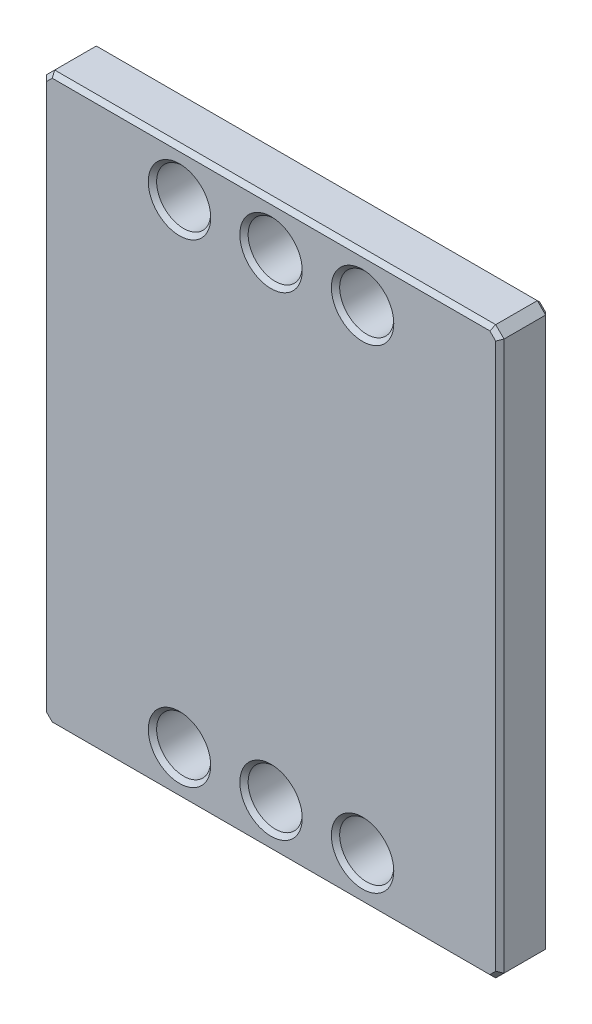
ISO-10303-21;
HEADER;
FILE_DESCRIPTION(('STEP AP214'),'2;1');
FILE_NAME('part.step','',(''),(''),'','','');
FILE_SCHEMA(('AUTOMOTIVE_DESIGN { 1 0 10303 214 1 1 1 1 }'));
ENDSEC;
DATA;
#1=APPLICATION_CONTEXT('core data for automotive mechanical design processes');
#2=APPLICATION_PROTOCOL_DEFINITION('international standard','automotive_design',2000,#1);
#3=PRODUCT_CONTEXT('',#1,'mechanical');
#4=PRODUCT('Part','Part','',(#3));
#5=PRODUCT_RELATED_PRODUCT_CATEGORY('part','',(#4));
#6=PRODUCT_DEFINITION_FORMATION('','',#4);
#7=PRODUCT_DEFINITION_CONTEXT('part definition',#1,'design');
#8=PRODUCT_DEFINITION('design','',#6,#7);
#9=PRODUCT_DEFINITION_SHAPE('','',#8);
#10=(LENGTH_UNIT() NAMED_UNIT(*) SI_UNIT(.MILLI.,.METRE.));
#11=(NAMED_UNIT(*) PLANE_ANGLE_UNIT() SI_UNIT($,.RADIAN.));
#12=(NAMED_UNIT(*) SI_UNIT($,.STERADIAN.) SOLID_ANGLE_UNIT());
#13=UNCERTAINTY_MEASURE_WITH_UNIT(LENGTH_MEASURE(1.E-05),#10,'distance_accuracy_value','');
#14=(GEOMETRIC_REPRESENTATION_CONTEXT(3) GLOBAL_UNCERTAINTY_ASSIGNED_CONTEXT((#13)) GLOBAL_UNIT_ASSIGNED_CONTEXT((#10,
#11,#12)) REPRESENTATION_CONTEXT('',''));
#15=CARTESIAN_POINT('',(0.,0.,0.));
#16=DIRECTION('',(0.,0.,1.));
#17=DIRECTION('',(1.,0.,0.));
#18=AXIS2_PLACEMENT_3D('',#15,#16,#17);
#19=CARTESIAN_POINT('',(0.,0.,6.));
#20=DIRECTION('',(0.,0.,1.));
#21=DIRECTION('',(1.,0.,0.));
#22=AXIS2_PLACEMENT_3D('',#19,#20,#21);
#23=PLANE('',#22);
#24=CARTESIAN_POINT('',(-10.9999999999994,5.5,6.));
#25=DIRECTION('',(0.,0.,1.));
#26=DIRECTION('',(1.,0.,0.));
#27=AXIS2_PLACEMENT_3D('',#24,#25,#26);
#28=CIRCLE('',#27,3.75000000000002);
#29=CARTESIAN_POINT('',(-7.24999999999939,5.5,6.));
#30=VERTEX_POINT('',#29);
#31=EDGE_CURVE('E11',#30,#30,#28,.F.);
#32=ORIENTED_EDGE('',*,*,#31,.T.);
#33=EDGE_LOOP('',(#32));
#34=FACE_BOUND('',#33,.T.);
#35=CARTESIAN_POINT('',(5.96744875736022E-13,5.5,6.));
#36=DIRECTION('',(0.,0.,1.));
#37=DIRECTION('',(1.,0.,0.));
#38=AXIS2_PLACEMENT_3D('',#35,#36,#37);
#39=CIRCLE('',#38,3.75000000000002);
#40=CARTESIAN_POINT('',(3.75000000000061,5.5,6.));
#41=VERTEX_POINT('',#40);
#42=EDGE_CURVE('E42',#41,#41,#39,.F.);
#43=ORIENTED_EDGE('',*,*,#42,.T.);
#44=EDGE_LOOP('',(#43));
#45=FACE_BOUND('',#44,.T.);
#46=CARTESIAN_POINT('',(0.,62.5,6.));
#47=DIRECTION('',(0.,0.,1.));
#48=DIRECTION('',(1.,0.,0.));
#49=AXIS2_PLACEMENT_3D('',#46,#47,#48);
#50=CIRCLE('',#49,3.75000000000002);
#51=CARTESIAN_POINT('',(3.75000000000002,62.5,6.));
#52=VERTEX_POINT('',#51);
#53=EDGE_CURVE('E280',#52,#52,#50,.F.);
#54=ORIENTED_EDGE('',*,*,#53,.T.);
#55=EDGE_LOOP('',(#54));
#56=FACE_BOUND('',#55,.T.);
#57=DIRECTION('',(0.,-1.,0.));
#58=VECTOR('',#57,1.);
#59=CARTESIAN_POINT('',(-27.,1.00000000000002,6.));
#60=LINE('',#59,#58);
#61=CARTESIAN_POINT('',(-27.,66.7928932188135,6.));
#62=VERTEX_POINT('',#61);
#63=CARTESIAN_POINT('',(-27.,1.20710678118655,6.));
#64=VERTEX_POINT('',#63);
#65=EDGE_CURVE('E50',#62,#64,#60,.T.);
#66=ORIENTED_EDGE('',*,*,#65,.T.);
#67=DIRECTION('',(0.70710678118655,-0.707106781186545,0.));
#68=VECTOR('',#67,1.);
#69=CARTESIAN_POINT('',(-12.8964466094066,-12.8964466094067,6.));
#70=LINE('',#69,#68);
#71=CARTESIAN_POINT('',(-26.2928932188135,0.5,6.));
#72=VERTEX_POINT('',#71);
#73=EDGE_CURVE('E278',#64,#72,#70,.T.);
#74=ORIENTED_EDGE('',*,*,#73,.T.);
#75=DIRECTION('',(1.,0.,0.));
#76=VECTOR('',#75,1.);
#77=CARTESIAN_POINT('',(26.5,0.5,6.));
#78=LINE('',#77,#76);
#79=CARTESIAN_POINT('',(26.2928932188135,0.5,6.));
#80=VERTEX_POINT('',#79);
#81=EDGE_CURVE('E266',#72,#80,#78,.T.);
#82=ORIENTED_EDGE('',*,*,#81,.T.);
#83=DIRECTION('',(0.707106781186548,0.707106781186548,0.));
#84=VECTOR('',#83,1.);
#85=CARTESIAN_POINT('',(12.8964466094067,-12.8964466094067,6.));
#86=LINE('',#85,#84);
#87=CARTESIAN_POINT('',(27.,1.20710678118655,6.));
#88=VERTEX_POINT('',#87);
#89=EDGE_CURVE('E268',#80,#88,#86,.T.);
#90=ORIENTED_EDGE('',*,*,#89,.T.);
#91=DIRECTION('',(0.,1.,0.));
#92=VECTOR('',#91,1.);
#93=CARTESIAN_POINT('',(27.,67.,6.));
#94=LINE('',#93,#92);
#95=CARTESIAN_POINT('',(27.,66.7928932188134,6.));
#96=VERTEX_POINT('',#95);
#97=EDGE_CURVE('E270',#88,#96,#94,.T.);
#98=ORIENTED_EDGE('',*,*,#97,.T.);
#99=DIRECTION('',(-0.70710678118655,0.707106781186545,0.));
#100=VECTOR('',#99,1.);
#101=CARTESIAN_POINT('',(46.8964466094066,46.896446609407,6.));
#102=LINE('',#101,#100);
#103=CARTESIAN_POINT('',(26.2928932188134,67.5,6.));
#104=VERTEX_POINT('',#103);
#105=EDGE_CURVE('E272',#96,#104,#102,.T.);
#106=ORIENTED_EDGE('',*,*,#105,.T.);
#107=DIRECTION('',(-1.,0.,0.));
#108=VECTOR('',#107,1.);
#109=CARTESIAN_POINT('',(-26.5,67.5,6.));
#110=LINE('',#109,#108);
#111=CARTESIAN_POINT('',(-26.2928932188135,67.5,6.));
#112=VERTEX_POINT('',#111);
#113=EDGE_CURVE('E274',#104,#112,#110,.T.);
#114=ORIENTED_EDGE('',*,*,#113,.T.);
#115=DIRECTION('',(-0.707106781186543,-0.707106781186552,0.));
#116=VECTOR('',#115,1.);
#117=CARTESIAN_POINT('',(-46.8964466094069,46.8964466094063,6.));
#118=LINE('',#117,#116);
#119=EDGE_CURVE('E55',#112,#62,#118,.T.);
#120=ORIENTED_EDGE('',*,*,#119,.T.);
#121=EDGE_LOOP('',(#66,#74,#82,#90,#98,#106,#114,#120));
#122=FACE_BOUND('',#121,.T.);
#123=CARTESIAN_POINT('',(-11.,62.5,6.));
#124=DIRECTION('',(0.,0.,1.));
#125=DIRECTION('',(1.,0.,0.));
#126=AXIS2_PLACEMENT_3D('',#123,#124,#125);
#127=CIRCLE('',#126,3.75000000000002);
#128=CARTESIAN_POINT('',(-7.24999999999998,62.5,6.));
#129=VERTEX_POINT('',#128);
#130=EDGE_CURVE('E263',#129,#129,#127,.F.);
#131=ORIENTED_EDGE('',*,*,#130,.T.);
#132=EDGE_LOOP('',(#131));
#133=FACE_BOUND('',#132,.T.);
#134=CARTESIAN_POINT('',(11.,62.5,6.));
#135=DIRECTION('',(0.,0.,1.));
#136=DIRECTION('',(1.,0.,0.));
#137=AXIS2_PLACEMENT_3D('',#134,#135,#136);
#138=CIRCLE('',#137,3.75000000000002);
#139=CARTESIAN_POINT('',(14.75,62.5,6.));
#140=VERTEX_POINT('',#139);
#141=EDGE_CURVE('E260',#140,#140,#138,.F.);
#142=ORIENTED_EDGE('',*,*,#141,.T.);
#143=EDGE_LOOP('',(#142));
#144=FACE_BOUND('',#143,.T.);
#145=CARTESIAN_POINT('',(11.0000000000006,5.5,6.));
#146=DIRECTION('',(0.,0.,1.));
#147=DIRECTION('',(1.,0.,0.));
#148=AXIS2_PLACEMENT_3D('',#145,#146,#147);
#149=CIRCLE('',#148,3.75000000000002);
#150=CARTESIAN_POINT('',(14.7500000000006,5.5,6.));
#151=VERTEX_POINT('',#150);
#152=EDGE_CURVE('E257',#151,#151,#149,.F.);
#153=ORIENTED_EDGE('',*,*,#152,.T.);
#154=EDGE_LOOP('',(#153));
#155=FACE_BOUND('',#154,.T.);
#156=ADVANCED_FACE('F33',(#34,#45,#56,#122,#133,#144,#155),#23,.T.);
#157=CARTESIAN_POINT('',(0.,0.,0.));
#158=DIRECTION('',(0.,0.,1.));
#159=DIRECTION('',(1.,0.,0.));
#160=AXIS2_PLACEMENT_3D('',#157,#158,#159);
#161=PLANE('',#160);
#162=CARTESIAN_POINT('',(-10.9999999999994,5.5,0.));
#163=DIRECTION('',(0.,0.,1.));
#164=DIRECTION('',(1.,0.,0.));
#165=AXIS2_PLACEMENT_3D('',#162,#163,#164);
#166=CIRCLE('',#165,3.74999999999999);
#167=CARTESIAN_POINT('',(-7.24999999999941,5.5,0.));
#168=VERTEX_POINT('',#167);
#169=EDGE_CURVE('E186',#168,#168,#166,.T.);
#170=ORIENTED_EDGE('',*,*,#169,.T.);
#171=EDGE_LOOP('',(#170));
#172=FACE_BOUND('',#171,.T.);
#173=CARTESIAN_POINT('',(5.96744875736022E-13,5.5,0.));
#174=DIRECTION('',(0.,0.,1.));
#175=DIRECTION('',(1.,0.,0.));
#176=AXIS2_PLACEMENT_3D('',#173,#174,#175);
#177=CIRCLE('',#176,3.74999999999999);
#178=CARTESIAN_POINT('',(3.75000000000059,5.5,0.));
#179=VERTEX_POINT('',#178);
#180=EDGE_CURVE('E178',#179,#179,#177,.T.);
#181=ORIENTED_EDGE('',*,*,#180,.T.);
#182=EDGE_LOOP('',(#181));
#183=FACE_BOUND('',#182,.T.);
#184=CARTESIAN_POINT('',(0.,62.5,0.));
#185=DIRECTION('',(0.,0.,1.));
#186=DIRECTION('',(1.,0.,0.));
#187=AXIS2_PLACEMENT_3D('',#184,#185,#186);
#188=CIRCLE('',#187,3.74999999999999);
#189=CARTESIAN_POINT('',(3.74999999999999,62.5,0.));
#190=VERTEX_POINT('',#189);
#191=EDGE_CURVE('E175',#190,#190,#188,.T.);
#192=ORIENTED_EDGE('',*,*,#191,.T.);
#193=EDGE_LOOP('',(#192));
#194=FACE_BOUND('',#193,.T.);
#195=DIRECTION('',(1.,0.,0.));
#196=VECTOR('',#195,1.);
#197=CARTESIAN_POINT('',(0.,67.5,0.));
#198=LINE('',#197,#196);
#199=CARTESIAN_POINT('',(-26.2928932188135,67.5,0.));
#200=VERTEX_POINT('',#199);
#201=CARTESIAN_POINT('',(26.2928932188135,67.5,0.));
#202=VERTEX_POINT('',#201);
#203=EDGE_CURVE('E173',#200,#202,#198,.T.);
#204=ORIENTED_EDGE('',*,*,#203,.T.);
#205=DIRECTION('',(0.70710678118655,-0.707106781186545,0.));
#206=VECTOR('',#205,1.);
#207=CARTESIAN_POINT('',(27.1464466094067,66.6464466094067,0.));
#208=LINE('',#207,#206);
#209=CARTESIAN_POINT('',(27.,66.7928932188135,0.));
#210=VERTEX_POINT('',#209);
#211=EDGE_CURVE('E153',#202,#210,#208,.T.);
#212=ORIENTED_EDGE('',*,*,#211,.T.);
#213=DIRECTION('',(0.,-1.,0.));
#214=VECTOR('',#213,1.);
#215=CARTESIAN_POINT('',(27.,0.,0.));
#216=LINE('',#215,#214);
#217=CARTESIAN_POINT('',(27.,1.20710678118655,0.));
#218=VERTEX_POINT('',#217);
#219=EDGE_CURVE('E161',#210,#218,#216,.T.);
#220=ORIENTED_EDGE('',*,*,#219,.T.);
#221=DIRECTION('',(-0.707106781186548,-0.707106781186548,0.));
#222=VECTOR('',#221,1.);
#223=CARTESIAN_POINT('',(26.1464466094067,0.353553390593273,0.));
#224=LINE('',#223,#222);
#225=CARTESIAN_POINT('',(26.2928932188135,0.500000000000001,0.));
#226=VERTEX_POINT('',#225);
#227=EDGE_CURVE('E167',#218,#226,#224,.T.);
#228=ORIENTED_EDGE('',*,*,#227,.T.);
#229=DIRECTION('',(-1.,0.,0.));
#230=VECTOR('',#229,1.);
#231=CARTESIAN_POINT('',(0.,0.5,0.));
#232=LINE('',#231,#230);
#233=CARTESIAN_POINT('',(-26.2928932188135,0.5,0.));
#234=VERTEX_POINT('',#233);
#235=EDGE_CURVE('E375',#226,#234,#232,.T.);
#236=ORIENTED_EDGE('',*,*,#235,.T.);
#237=DIRECTION('',(-0.70710678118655,0.707106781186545,0.));
#238=VECTOR('',#237,1.);
#239=CARTESIAN_POINT('',(-27.1464466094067,1.35355339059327,0.));
#240=LINE('',#239,#238);
#241=CARTESIAN_POINT('',(-27.,1.20710678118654,0.));
#242=VERTEX_POINT('',#241);
#243=EDGE_CURVE('E377',#234,#242,#240,.T.);
#244=ORIENTED_EDGE('',*,*,#243,.T.);
#245=DIRECTION('',(0.,1.,0.));
#246=VECTOR('',#245,1.);
#247=CARTESIAN_POINT('',(-27.,0.,0.));
#248=LINE('',#247,#246);
#249=CARTESIAN_POINT('',(-27.,66.7928932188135,0.));
#250=VERTEX_POINT('',#249);
#251=EDGE_CURVE('E379',#242,#250,#248,.T.);
#252=ORIENTED_EDGE('',*,*,#251,.T.);
#253=DIRECTION('',(0.707106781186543,0.707106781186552,0.));
#254=VECTOR('',#253,1.);
#255=CARTESIAN_POINT('',(-26.1464466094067,67.6464466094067,0.));
#256=LINE('',#255,#254);
#257=EDGE_CURVE('E180',#250,#200,#256,.T.);
#258=ORIENTED_EDGE('',*,*,#257,.T.);
#259=EDGE_LOOP('',(#204,#212,#220,#228,#236,#244,#252,#258));
#260=FACE_BOUND('',#259,.T.);
#261=CARTESIAN_POINT('',(-11.,62.5,0.));
#262=DIRECTION('',(0.,0.,1.));
#263=DIRECTION('',(1.,0.,0.));
#264=AXIS2_PLACEMENT_3D('',#261,#262,#263);
#265=CIRCLE('',#264,3.74999999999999);
#266=CARTESIAN_POINT('',(-7.25000000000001,62.5,0.));
#267=VERTEX_POINT('',#266);
#268=EDGE_CURVE('E168',#267,#267,#265,.T.);
#269=ORIENTED_EDGE('',*,*,#268,.T.);
#270=EDGE_LOOP('',(#269));
#271=FACE_BOUND('',#270,.T.);
#272=CARTESIAN_POINT('',(11.,62.5,0.));
#273=DIRECTION('',(0.,0.,1.));
#274=DIRECTION('',(1.,0.,0.));
#275=AXIS2_PLACEMENT_3D('',#272,#273,#274);
#276=CIRCLE('',#275,3.74999999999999);
#277=CARTESIAN_POINT('',(14.75,62.5,0.));
#278=VERTEX_POINT('',#277);
#279=EDGE_CURVE('E369',#278,#278,#276,.T.);
#280=ORIENTED_EDGE('',*,*,#279,.T.);
#281=EDGE_LOOP('',(#280));
#282=FACE_BOUND('',#281,.T.);
#283=CARTESIAN_POINT('',(11.0000000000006,5.5,0.));
#284=DIRECTION('',(0.,0.,1.));
#285=DIRECTION('',(1.,0.,0.));
#286=AXIS2_PLACEMENT_3D('',#283,#284,#285);
#287=CIRCLE('',#286,3.74999999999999);
#288=CARTESIAN_POINT('',(14.7500000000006,5.5,0.));
#289=VERTEX_POINT('',#288);
#290=EDGE_CURVE('E366',#289,#289,#287,.T.);
#291=ORIENTED_EDGE('',*,*,#290,.T.);
#292=EDGE_LOOP('',(#291));
#293=FACE_BOUND('',#292,.T.);
#294=ADVANCED_FACE('F170',(#172,#183,#194,#260,#271,#282,#293),#161,.F.);
#295=CARTESIAN_POINT('',(-27.5,68.,6.));
#296=DIRECTION('',(1.,0.,0.));
#297=DIRECTION('',(0.,1.,0.));
#298=AXIS2_PLACEMENT_3D('',#295,#296,#297);
#299=PLANE('',#298);
#300=DIRECTION('',(0.,0.,-1.));
#301=VECTOR('',#300,1.);
#302=CARTESIAN_POINT('',(-27.5,67.,6.));
#303=LINE('',#302,#301);
#304=CARTESIAN_POINT('',(-27.5,67.,5.5));
#305=VERTEX_POINT('',#304);
#306=CARTESIAN_POINT('',(-27.5,67.,0.5));
#307=VERTEX_POINT('',#306);
#308=EDGE_CURVE('E356',#305,#307,#303,.T.);
#309=ORIENTED_EDGE('',*,*,#308,.T.);
#310=DIRECTION('',(0.,-1.,0.));
#311=VECTOR('',#310,1.);
#312=CARTESIAN_POINT('',(-27.5,68.,0.5));
#313=LINE('',#312,#311);
#314=CARTESIAN_POINT('',(-27.5,1.,0.5));
#315=VERTEX_POINT('',#314);
#316=EDGE_CURVE('E220',#307,#315,#313,.T.);
#317=ORIENTED_EDGE('',*,*,#316,.T.);
#318=DIRECTION('',(0.,0.,1.));
#319=VECTOR('',#318,1.);
#320=CARTESIAN_POINT('',(-27.5,1.,6.));
#321=LINE('',#320,#319);
#322=CARTESIAN_POINT('',(-27.5,1.,5.5));
#323=VERTEX_POINT('',#322);
#324=EDGE_CURVE('E359',#315,#323,#321,.T.);
#325=ORIENTED_EDGE('',*,*,#324,.T.);
#326=DIRECTION('',(0.,1.,0.));
#327=VECTOR('',#326,1.);
#328=CARTESIAN_POINT('',(-27.5,67.,5.5));
#329=LINE('',#328,#327);
#330=EDGE_CURVE('E218',#323,#305,#329,.T.);
#331=ORIENTED_EDGE('',*,*,#330,.T.);
#332=EDGE_LOOP('',(#309,#317,#325,#331));
#333=FACE_BOUND('',#332,.T.);
#334=ADVANCED_FACE('F436',(#333),#299,.F.);
#335=CARTESIAN_POINT('',(-27.5,0.,6.));
#336=DIRECTION('',(0.,1.,0.));
#337=DIRECTION('',(0.,0.,1.));
#338=AXIS2_PLACEMENT_3D('',#335,#336,#337);
#339=PLANE('',#338);
#340=DIRECTION('',(0.,0.,-1.));
#341=VECTOR('',#340,1.);
#342=CARTESIAN_POINT('',(-26.5,0.,6.));
#343=LINE('',#342,#341);
#344=CARTESIAN_POINT('',(-26.5,0.,5.5));
#345=VERTEX_POINT('',#344);
#346=CARTESIAN_POINT('',(-26.5,0.,0.5));
#347=VERTEX_POINT('',#346);
#348=EDGE_CURVE('E348',#345,#347,#343,.T.);
#349=ORIENTED_EDGE('',*,*,#348,.T.);
#350=DIRECTION('',(1.,0.,0.));
#351=VECTOR('',#350,1.);
#352=CARTESIAN_POINT('',(-27.5,0.,0.5));
#353=LINE('',#352,#351);
#354=CARTESIAN_POINT('',(26.5,0.,0.5));
#355=VERTEX_POINT('',#354);
#356=EDGE_CURVE('E229',#347,#355,#353,.T.);
#357=ORIENTED_EDGE('',*,*,#356,.T.);
#358=DIRECTION('',(0.,0.,1.));
#359=VECTOR('',#358,1.);
#360=CARTESIAN_POINT('',(26.5,0.,6.));
#361=LINE('',#360,#359);
#362=CARTESIAN_POINT('',(26.5,0.,5.5));
#363=VERTEX_POINT('',#362);
#364=EDGE_CURVE('E353',#355,#363,#361,.T.);
#365=ORIENTED_EDGE('',*,*,#364,.T.);
#366=DIRECTION('',(-1.,0.,0.));
#367=VECTOR('',#366,1.);
#368=CARTESIAN_POINT('',(-26.5,0.,5.5));
#369=LINE('',#368,#367);
#370=EDGE_CURVE('E227',#363,#345,#369,.T.);
#371=ORIENTED_EDGE('',*,*,#370,.T.);
#372=EDGE_LOOP('',(#349,#357,#365,#371));
#373=FACE_BOUND('',#372,.T.);
#374=ADVANCED_FACE('F420',(#373),#339,.F.);
#375=CARTESIAN_POINT('',(27.5,68.,6.));
#376=DIRECTION('',(-1.,0.,0.));
#377=DIRECTION('',(0.,-1.,0.));
#378=AXIS2_PLACEMENT_3D('',#375,#376,#377);
#379=PLANE('',#378);
#380=DIRECTION('',(0.,0.,-1.));
#381=VECTOR('',#380,1.);
#382=CARTESIAN_POINT('',(27.5,1.,6.));
#383=LINE('',#382,#381);
#384=CARTESIAN_POINT('',(27.5,1.,5.5));
#385=VERTEX_POINT('',#384);
#386=CARTESIAN_POINT('',(27.5,1.,0.5));
#387=VERTEX_POINT('',#386);
#388=EDGE_CURVE('E346',#385,#387,#383,.T.);
#389=ORIENTED_EDGE('',*,*,#388,.T.);
#390=DIRECTION('',(0.,1.,0.));
#391=VECTOR('',#390,1.);
#392=CARTESIAN_POINT('',(27.5,68.,0.5));
#393=LINE('',#392,#391);
#394=CARTESIAN_POINT('',(27.5,67.,0.5));
#395=VERTEX_POINT('',#394);
#396=EDGE_CURVE('E237',#387,#395,#393,.T.);
#397=ORIENTED_EDGE('',*,*,#396,.T.);
#398=DIRECTION('',(0.,0.,1.));
#399=VECTOR('',#398,1.);
#400=CARTESIAN_POINT('',(27.5,67.,6.));
#401=LINE('',#400,#399);
#402=CARTESIAN_POINT('',(27.5,67.,5.5));
#403=VERTEX_POINT('',#402);
#404=EDGE_CURVE('E302',#395,#403,#401,.T.);
#405=ORIENTED_EDGE('',*,*,#404,.T.);
#406=DIRECTION('',(0.,-1.,0.));
#407=VECTOR('',#406,1.);
#408=CARTESIAN_POINT('',(27.5,1.00000000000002,5.5));
#409=LINE('',#408,#407);
#410=EDGE_CURVE('E235',#403,#385,#409,.T.);
#411=ORIENTED_EDGE('',*,*,#410,.T.);
#412=EDGE_LOOP('',(#389,#397,#405,#411));
#413=FACE_BOUND('',#412,.T.);
#414=ADVANCED_FACE('F344',(#413),#379,.F.);
#415=CARTESIAN_POINT('',(-27.5,68.,6.));
#416=DIRECTION('',(0.,-1.,0.));
#417=DIRECTION('',(0.,0.,-1.));
#418=AXIS2_PLACEMENT_3D('',#415,#416,#417);
#419=PLANE('',#418);
#420=DIRECTION('',(0.,0.,-1.));
#421=VECTOR('',#420,1.);
#422=CARTESIAN_POINT('',(26.5,68.,6.));
#423=LINE('',#422,#421);
#424=CARTESIAN_POINT('',(26.5,68.,5.5));
#425=VERTEX_POINT('',#424);
#426=CARTESIAN_POINT('',(26.5,68.,0.5));
#427=VERTEX_POINT('',#426);
#428=EDGE_CURVE('E341',#425,#427,#423,.T.);
#429=ORIENTED_EDGE('',*,*,#428,.T.);
#430=DIRECTION('',(-1.,0.,0.));
#431=VECTOR('',#430,1.);
#432=CARTESIAN_POINT('',(-27.5,68.,0.5));
#433=LINE('',#432,#431);
#434=CARTESIAN_POINT('',(-26.5,68.,0.5));
#435=VERTEX_POINT('',#434);
#436=EDGE_CURVE('E212',#427,#435,#433,.T.);
#437=ORIENTED_EDGE('',*,*,#436,.T.);
#438=DIRECTION('',(0.,0.,1.));
#439=VECTOR('',#438,1.);
#440=CARTESIAN_POINT('',(-26.5,68.,6.));
#441=LINE('',#440,#439);
#442=CARTESIAN_POINT('',(-26.5,68.,5.5));
#443=VERTEX_POINT('',#442);
#444=EDGE_CURVE('E362',#435,#443,#441,.T.);
#445=ORIENTED_EDGE('',*,*,#444,.T.);
#446=DIRECTION('',(1.,0.,0.));
#447=VECTOR('',#446,1.);
#448=CARTESIAN_POINT('',(26.5,68.,5.5));
#449=LINE('',#448,#447);
#450=EDGE_CURVE('E210',#443,#425,#449,.T.);
#451=ORIENTED_EDGE('',*,*,#450,.T.);
#452=EDGE_LOOP('',(#429,#437,#445,#451));
#453=FACE_BOUND('',#452,.T.);
#454=ADVANCED_FACE('F392',(#453),#419,.F.);
#455=CARTESIAN_POINT('',(-11.,62.5,6.));
#456=DIRECTION('',(0.,0.,-1.));
#457=DIRECTION('',(-1.,0.,0.));
#458=AXIS2_PLACEMENT_3D('',#455,#456,#457);
#459=CYLINDRICAL_SURFACE('',#458,3.25);
#460=CARTESIAN_POINT('',(-11.,62.5,0.499999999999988));
#461=DIRECTION('',(0.,0.,1.));
#462=DIRECTION('',(1.,0.,0.));
#463=AXIS2_PLACEMENT_3D('',#460,#461,#462);
#464=CIRCLE('',#463,3.25);
#465=CARTESIAN_POINT('',(-7.75,62.5,0.499999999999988));
#466=VERTEX_POINT('',#465);
#467=EDGE_CURVE('E242',#466,#466,#464,.F.);
#468=ORIENTED_EDGE('',*,*,#467,.T.);
#469=EDGE_LOOP('',(#468));
#470=FACE_BOUND('',#469,.T.);
#471=CARTESIAN_POINT('',(-11.,62.5,5.49999999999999));
#472=DIRECTION('',(0.,0.,1.));
#473=DIRECTION('',(1.,0.,0.));
#474=AXIS2_PLACEMENT_3D('',#471,#472,#473);
#475=CIRCLE('',#474,3.25);
#476=CARTESIAN_POINT('',(-7.75,62.5,5.49999999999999));
#477=VERTEX_POINT('',#476);
#478=EDGE_CURVE('E239',#477,#477,#475,.T.);
#479=ORIENTED_EDGE('',*,*,#478,.T.);
#480=EDGE_LOOP('',(#479));
#481=FACE_BOUND('',#480,.T.);
#482=ADVANCED_FACE('F454',(#470,#481),#459,.F.);
#483=CARTESIAN_POINT('',(0.,62.5,6.));
#484=DIRECTION('',(0.,0.,-1.));
#485=DIRECTION('',(-1.,0.,0.));
#486=AXIS2_PLACEMENT_3D('',#483,#484,#485);
#487=CYLINDRICAL_SURFACE('',#486,3.25);
#488=CARTESIAN_POINT('',(0.,62.5,0.499999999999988));
#489=DIRECTION('',(0.,0.,1.));
#490=DIRECTION('',(1.,0.,0.));
#491=AXIS2_PLACEMENT_3D('',#488,#489,#490);
#492=CIRCLE('',#491,3.25);
#493=CARTESIAN_POINT('',(3.25,62.5,0.499999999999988));
#494=VERTEX_POINT('',#493);
#495=EDGE_CURVE('E204',#494,#494,#492,.F.);
#496=ORIENTED_EDGE('',*,*,#495,.T.);
#497=EDGE_LOOP('',(#496));
#498=FACE_BOUND('',#497,.T.);
#499=CARTESIAN_POINT('',(0.,62.5,5.49999999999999));
#500=DIRECTION('',(0.,0.,1.));
#501=DIRECTION('',(1.,0.,0.));
#502=AXIS2_PLACEMENT_3D('',#499,#500,#501);
#503=CIRCLE('',#502,3.25);
#504=CARTESIAN_POINT('',(3.25,62.5,5.49999999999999));
#505=VERTEX_POINT('',#504);
#506=EDGE_CURVE('E201',#505,#505,#503,.T.);
#507=ORIENTED_EDGE('',*,*,#506,.T.);
#508=EDGE_LOOP('',(#507));
#509=FACE_BOUND('',#508,.T.);
#510=ADVANCED_FACE('F474',(#498,#509),#487,.F.);
#511=CARTESIAN_POINT('',(11.,62.5,6.));
#512=DIRECTION('',(0.,0.,-1.));
#513=DIRECTION('',(-1.,0.,0.));
#514=AXIS2_PLACEMENT_3D('',#511,#512,#513);
#515=CYLINDRICAL_SURFACE('',#514,3.25);
#516=CARTESIAN_POINT('',(11.,62.5,0.499999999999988));
#517=DIRECTION('',(0.,0.,1.));
#518=DIRECTION('',(1.,0.,0.));
#519=AXIS2_PLACEMENT_3D('',#516,#517,#518);
#520=CIRCLE('',#519,3.25);
#521=CARTESIAN_POINT('',(14.25,62.5,0.499999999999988));
#522=VERTEX_POINT('',#521);
#523=EDGE_CURVE('E248',#522,#522,#520,.F.);
#524=ORIENTED_EDGE('',*,*,#523,.T.);
#525=EDGE_LOOP('',(#524));
#526=FACE_BOUND('',#525,.T.);
#527=CARTESIAN_POINT('',(11.,62.5,5.49999999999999));
#528=DIRECTION('',(0.,0.,1.));
#529=DIRECTION('',(1.,0.,0.));
#530=AXIS2_PLACEMENT_3D('',#527,#528,#529);
#531=CIRCLE('',#530,3.25);
#532=CARTESIAN_POINT('',(14.25,62.5,5.49999999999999));
#533=VERTEX_POINT('',#532);
#534=EDGE_CURVE('E245',#533,#533,#531,.T.);
#535=ORIENTED_EDGE('',*,*,#534,.T.);
#536=EDGE_LOOP('',(#535));
#537=FACE_BOUND('',#536,.T.);
#538=ADVANCED_FACE('F481',(#526,#537),#515,.F.);
#539=CARTESIAN_POINT('',(5.96744875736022E-13,5.5,6.));
#540=DIRECTION('',(0.,0.,-1.));
#541=DIRECTION('',(-1.,0.,0.));
#542=AXIS2_PLACEMENT_3D('',#539,#540,#541);
#543=CYLINDRICAL_SURFACE('',#542,3.25);
#544=CARTESIAN_POINT('',(5.96744875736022E-13,5.5,0.499999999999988));
#545=DIRECTION('',(0.,0.,1.));
#546=DIRECTION('',(1.,0.,0.));
#547=AXIS2_PLACEMENT_3D('',#544,#545,#546);
#548=CIRCLE('',#547,3.25);
#549=CARTESIAN_POINT('',(3.2500000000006,5.5,0.499999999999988));
#550=VERTEX_POINT('',#549);
#551=EDGE_CURVE('E198',#550,#550,#548,.F.);
#552=ORIENTED_EDGE('',*,*,#551,.T.);
#553=EDGE_LOOP('',(#552));
#554=FACE_BOUND('',#553,.T.);
#555=CARTESIAN_POINT('',(5.96744875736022E-13,5.5,5.49999999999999));
#556=DIRECTION('',(0.,0.,1.));
#557=DIRECTION('',(1.,0.,0.));
#558=AXIS2_PLACEMENT_3D('',#555,#556,#557);
#559=CIRCLE('',#558,3.25);
#560=CARTESIAN_POINT('',(3.2500000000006,5.5,5.49999999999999));
#561=VERTEX_POINT('',#560);
#562=EDGE_CURVE('E195',#561,#561,#559,.T.);
#563=ORIENTED_EDGE('',*,*,#562,.T.);
#564=EDGE_LOOP('',(#563));
#565=FACE_BOUND('',#564,.T.);
#566=ADVANCED_FACE('F488',(#554,#565),#543,.F.);
#567=CARTESIAN_POINT('',(11.0000000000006,5.5,6.));
#568=DIRECTION('',(0.,0.,-1.));
#569=DIRECTION('',(-1.,0.,0.));
#570=AXIS2_PLACEMENT_3D('',#567,#568,#569);
#571=CYLINDRICAL_SURFACE('',#570,3.25);
#572=CARTESIAN_POINT('',(11.0000000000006,5.5,0.499999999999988));
#573=DIRECTION('',(0.,0.,1.));
#574=DIRECTION('',(1.,0.,0.));
#575=AXIS2_PLACEMENT_3D('',#572,#573,#574);
#576=CIRCLE('',#575,3.25);
#577=CARTESIAN_POINT('',(14.2500000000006,5.5,0.499999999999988));
#578=VERTEX_POINT('',#577);
#579=EDGE_CURVE('E254',#578,#578,#576,.F.);
#580=ORIENTED_EDGE('',*,*,#579,.T.);
#581=EDGE_LOOP('',(#580));
#582=FACE_BOUND('',#581,.T.);
#583=CARTESIAN_POINT('',(11.0000000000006,5.5,5.49999999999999));
#584=DIRECTION('',(0.,0.,1.));
#585=DIRECTION('',(1.,0.,0.));
#586=AXIS2_PLACEMENT_3D('',#583,#584,#585);
#587=CIRCLE('',#586,3.25);
#588=CARTESIAN_POINT('',(14.2500000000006,5.5,5.49999999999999));
#589=VERTEX_POINT('',#588);
#590=EDGE_CURVE('E251',#589,#589,#587,.T.);
#591=ORIENTED_EDGE('',*,*,#590,.T.);
#592=EDGE_LOOP('',(#591));
#593=FACE_BOUND('',#592,.T.);
#594=ADVANCED_FACE('F496',(#582,#593),#571,.F.);
#595=CARTESIAN_POINT('',(-10.9999999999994,5.5,6.));
#596=DIRECTION('',(0.,0.,-1.));
#597=DIRECTION('',(-1.,0.,0.));
#598=AXIS2_PLACEMENT_3D('',#595,#596,#597);
#599=CYLINDRICAL_SURFACE('',#598,3.25);
#600=CARTESIAN_POINT('',(-10.9999999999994,5.5,0.499999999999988));
#601=DIRECTION('',(0.,0.,1.));
#602=DIRECTION('',(1.,0.,0.));
#603=AXIS2_PLACEMENT_3D('',#600,#601,#602);
#604=CIRCLE('',#603,3.25);
#605=CARTESIAN_POINT('',(-7.7499999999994,5.5,0.499999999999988));
#606=VERTEX_POINT('',#605);
#607=EDGE_CURVE('E192',#606,#606,#604,.F.);
#608=ORIENTED_EDGE('',*,*,#607,.T.);
#609=EDGE_LOOP('',(#608));
#610=FACE_BOUND('',#609,.T.);
#611=CARTESIAN_POINT('',(-10.9999999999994,5.5,5.49999999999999));
#612=DIRECTION('',(0.,0.,1.));
#613=DIRECTION('',(1.,0.,0.));
#614=AXIS2_PLACEMENT_3D('',#611,#612,#613);
#615=CIRCLE('',#614,3.25);
#616=CARTESIAN_POINT('',(-7.7499999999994,5.5,5.49999999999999));
#617=VERTEX_POINT('',#616);
#618=EDGE_CURVE('E189',#617,#617,#615,.T.);
#619=ORIENTED_EDGE('',*,*,#618,.T.);
#620=EDGE_LOOP('',(#619));
#621=FACE_BOUND('',#620,.T.);
#622=ADVANCED_FACE('F504',(#610,#621),#599,.F.);
#623=CARTESIAN_POINT('',(27.5,1.,6.));
#624=DIRECTION('',(-0.707106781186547,0.707106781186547,0.));
#625=DIRECTION('',(0.,0.,-1.));
#626=AXIS2_PLACEMENT_3D('',#623,#624,#625);
#627=PLANE('',#626);
#628=ORIENTED_EDGE('',*,*,#364,.F.);
#629=DIRECTION('',(-0.707106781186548,-0.707106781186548,0.));
#630=VECTOR('',#629,1.);
#631=CARTESIAN_POINT('',(27.5,1.00000000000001,0.500000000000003));
#632=LINE('',#631,#630);
#633=EDGE_CURVE('E233',#355,#387,#632,.F.);
#634=ORIENTED_EDGE('',*,*,#633,.T.);
#635=ORIENTED_EDGE('',*,*,#388,.F.);
#636=DIRECTION('',(0.707106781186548,0.707106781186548,0.));
#637=VECTOR('',#636,1.);
#638=CARTESIAN_POINT('',(27.5,1.,5.5));
#639=LINE('',#638,#637);
#640=EDGE_CURVE('E231',#385,#363,#639,.F.);
#641=ORIENTED_EDGE('',*,*,#640,.T.);
#642=EDGE_LOOP('',(#628,#634,#635,#641));
#643=FACE_BOUND('',#642,.T.);
#644=ADVANCED_FACE('F512',(#643),#627,.F.);
#645=CARTESIAN_POINT('',(-26.5,0.,6.));
#646=DIRECTION('',(0.707106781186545,0.70710678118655,0.));
#647=DIRECTION('',(0.,0.,-1.));
#648=AXIS2_PLACEMENT_3D('',#645,#646,#647);
#649=PLANE('',#648);
#650=ORIENTED_EDGE('',*,*,#324,.F.);
#651=DIRECTION('',(-0.70710678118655,0.707106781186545,0.));
#652=VECTOR('',#651,1.);
#653=CARTESIAN_POINT('',(-26.5,0.,0.499999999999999));
#654=LINE('',#653,#652);
#655=EDGE_CURVE('E225',#315,#347,#654,.F.);
#656=ORIENTED_EDGE('',*,*,#655,.T.);
#657=ORIENTED_EDGE('',*,*,#348,.F.);
#658=DIRECTION('',(0.70710678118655,-0.707106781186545,0.));
#659=VECTOR('',#658,1.);
#660=CARTESIAN_POINT('',(-26.5,0.,5.5));
#661=LINE('',#660,#659);
#662=EDGE_CURVE('E222',#345,#323,#661,.F.);
#663=ORIENTED_EDGE('',*,*,#662,.T.);
#664=EDGE_LOOP('',(#650,#656,#657,#663));
#665=FACE_BOUND('',#664,.T.);
#666=ADVANCED_FACE('F425',(#665),#649,.F.);
#667=CARTESIAN_POINT('',(26.5,68.,6.));
#668=DIRECTION('',(-0.707106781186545,-0.70710678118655,0.));
#669=DIRECTION('',(0.,0.,-1.));
#670=AXIS2_PLACEMENT_3D('',#667,#668,#669);
#671=PLANE('',#670);
#672=ORIENTED_EDGE('',*,*,#404,.F.);
#673=DIRECTION('',(0.70710678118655,-0.707106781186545,0.));
#674=VECTOR('',#673,1.);
#675=CARTESIAN_POINT('',(26.5,68.,0.500000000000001));
#676=LINE('',#675,#674);
#677=EDGE_CURVE('E155',#395,#427,#676,.F.);
#678=ORIENTED_EDGE('',*,*,#677,.T.);
#679=ORIENTED_EDGE('',*,*,#428,.F.);
#680=DIRECTION('',(-0.70710678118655,0.707106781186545,0.));
#681=VECTOR('',#680,1.);
#682=CARTESIAN_POINT('',(26.5,68.,5.5));
#683=LINE('',#682,#681);
#684=EDGE_CURVE('E207',#425,#403,#683,.F.);
#685=ORIENTED_EDGE('',*,*,#684,.T.);
#686=EDGE_LOOP('',(#672,#678,#679,#685));
#687=FACE_BOUND('',#686,.T.);
#688=ADVANCED_FACE('F339',(#687),#671,.F.);
#689=CARTESIAN_POINT('',(-27.5,67.,6.));
#690=DIRECTION('',(0.707106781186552,-0.707106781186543,0.));
#691=DIRECTION('',(0.,0.,-1.));
#692=AXIS2_PLACEMENT_3D('',#689,#690,#691);
#693=PLANE('',#692);
#694=ORIENTED_EDGE('',*,*,#444,.F.);
#695=DIRECTION('',(0.707106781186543,0.707106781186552,0.));
#696=VECTOR('',#695,1.);
#697=CARTESIAN_POINT('',(-27.5,67.,0.499999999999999));
#698=LINE('',#697,#696);
#699=EDGE_CURVE('E216',#435,#307,#698,.F.);
#700=ORIENTED_EDGE('',*,*,#699,.T.);
#701=ORIENTED_EDGE('',*,*,#308,.F.);
#702=DIRECTION('',(-0.707106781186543,-0.707106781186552,0.));
#703=VECTOR('',#702,1.);
#704=CARTESIAN_POINT('',(-27.5,67.,5.5));
#705=LINE('',#704,#703);
#706=EDGE_CURVE('E214',#305,#443,#705,.F.);
#707=ORIENTED_EDGE('',*,*,#706,.T.);
#708=EDGE_LOOP('',(#694,#700,#701,#707));
#709=FACE_BOUND('',#708,.T.);
#710=ADVANCED_FACE('F394',(#709),#693,.F.);
#711=CARTESIAN_POINT('',(-10.9999999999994,5.5,0.));
#712=DIRECTION('',(0.,0.,-1.));
#713=DIRECTION('',(-1.,0.,0.));
#714=AXIS2_PLACEMENT_3D('',#711,#712,#713);
#715=CONICAL_SURFACE('',#714,3.74999999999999,0.785398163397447);
#716=ORIENTED_EDGE('',*,*,#607,.F.);
#717=EDGE_LOOP('',(#716));
#718=FACE_BOUND('',#717,.T.);
#719=ORIENTED_EDGE('',*,*,#169,.F.);
#720=EDGE_LOOP('',(#719));
#721=FACE_BOUND('',#720,.T.);
#722=ADVANCED_FACE('F538',(#718,#721),#715,.F.);
#723=CARTESIAN_POINT('',(5.96744875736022E-13,5.5,0.));
#724=DIRECTION('',(0.,0.,-1.));
#725=DIRECTION('',(-1.,0.,0.));
#726=AXIS2_PLACEMENT_3D('',#723,#724,#725);
#727=CONICAL_SURFACE('',#726,3.74999999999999,0.785398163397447);
#728=ORIENTED_EDGE('',*,*,#551,.F.);
#729=EDGE_LOOP('',(#728));
#730=FACE_BOUND('',#729,.T.);
#731=ORIENTED_EDGE('',*,*,#180,.F.);
#732=EDGE_LOOP('',(#731));
#733=FACE_BOUND('',#732,.T.);
#734=ADVANCED_FACE('F545',(#730,#733),#727,.F.);
#735=CARTESIAN_POINT('',(0.,62.5,0.));
#736=DIRECTION('',(0.,0.,-1.));
#737=DIRECTION('',(-1.,0.,0.));
#738=AXIS2_PLACEMENT_3D('',#735,#736,#737);
#739=CONICAL_SURFACE('',#738,3.74999999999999,0.785398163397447);
#740=ORIENTED_EDGE('',*,*,#495,.F.);
#741=EDGE_LOOP('',(#740));
#742=FACE_BOUND('',#741,.T.);
#743=ORIENTED_EDGE('',*,*,#191,.F.);
#744=EDGE_LOOP('',(#743));
#745=FACE_BOUND('',#744,.T.);
#746=ADVANCED_FACE('F553',(#742,#745),#739,.F.);
#747=CARTESIAN_POINT('',(-12.8964466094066,-12.8964466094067,0.));
#748=DIRECTION('',(0.499999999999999,0.500000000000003,0.707106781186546));
#749=DIRECTION('',(-0.70710678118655,0.707106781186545,0.));
#750=AXIS2_PLACEMENT_3D('',#747,#748,#749);
#751=PLANE('',#750);
#752=DIRECTION('',(0.281084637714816,0.678598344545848,-0.678598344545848));
#753=VECTOR('',#752,1.);
#754=CARTESIAN_POINT('',(-26.5790085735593,-0.190743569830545,0.690743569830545));
#755=LINE('',#754,#753);
#756=EDGE_CURVE('E296',#347,#234,#755,.T.);
#757=ORIENTED_EDGE('',*,*,#756,.F.);
#758=ORIENTED_EDGE('',*,*,#655,.F.);
#759=DIRECTION('',(0.678598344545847,0.281084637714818,-0.678598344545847));
#760=VECTOR('',#759,1.);
#761=CARTESIAN_POINT('',(-23.1955362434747,2.78296726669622,-3.80446375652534));
#762=LINE('',#761,#760);
#763=EDGE_CURVE('E299',#242,#315,#762,.F.);
#764=ORIENTED_EDGE('',*,*,#763,.F.);
#765=ORIENTED_EDGE('',*,*,#243,.F.);
#766=EDGE_LOOP('',(#757,#758,#764,#765));
#767=FACE_BOUND('',#766,.T.);
#768=ADVANCED_FACE('F429',(#767),#751,.F.);
#769=CARTESIAN_POINT('',(-27.5,68.,0.5));
#770=DIRECTION('',(0.707106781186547,0.,0.707106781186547));
#771=DIRECTION('',(0.,-1.,0.));
#772=AXIS2_PLACEMENT_3D('',#769,#770,#771);
#773=PLANE('',#772);
#774=ORIENTED_EDGE('',*,*,#763,.T.);
#775=ORIENTED_EDGE('',*,*,#316,.F.);
#776=DIRECTION('',(0.678598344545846,-0.281084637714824,-0.678598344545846));
#777=VECTOR('',#776,1.);
#778=CARTESIAN_POINT('',(-27.6907435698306,67.0790085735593,0.690743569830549));
#779=LINE('',#778,#777);
#780=EDGE_CURVE('E293',#250,#307,#779,.F.);
#781=ORIENTED_EDGE('',*,*,#780,.F.);
#782=ORIENTED_EDGE('',*,*,#251,.F.);
#783=EDGE_LOOP('',(#774,#775,#781,#782));
#784=FACE_BOUND('',#783,.T.);
#785=ADVANCED_FACE('F434',(#784),#773,.F.);
#786=CARTESIAN_POINT('',(-27.5,0.,0.5));
#787=DIRECTION('',(0.,0.707106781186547,0.707106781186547));
#788=DIRECTION('',(1.,0.,0.));
#789=AXIS2_PLACEMENT_3D('',#786,#787,#788);
#790=PLANE('',#789);
#791=ORIENTED_EDGE('',*,*,#756,.T.);
#792=ORIENTED_EDGE('',*,*,#235,.F.);
#793=DIRECTION('',(-0.281084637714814,0.678598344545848,-0.678598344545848));
#794=VECTOR('',#793,1.);
#795=CARTESIAN_POINT('',(27.7897451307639,-3.1137201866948,3.6137201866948));
#796=LINE('',#795,#794);
#797=EDGE_CURVE('E290',#355,#226,#796,.T.);
#798=ORIENTED_EDGE('',*,*,#797,.F.);
#799=ORIENTED_EDGE('',*,*,#356,.F.);
#800=EDGE_LOOP('',(#791,#792,#798,#799));
#801=FACE_BOUND('',#800,.T.);
#802=ADVANCED_FACE('F574',(#801),#790,.F.);
#803=CARTESIAN_POINT('',(-46.8964466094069,46.8964466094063,0.));
#804=DIRECTION('',(0.500000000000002,-0.499999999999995,0.70710678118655));
#805=DIRECTION('',(0.707106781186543,0.707106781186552,0.));
#806=AXIS2_PLACEMENT_3D('',#803,#804,#805);
#807=PLANE('',#806);
#808=ORIENTED_EDGE('',*,*,#780,.T.);
#809=ORIENTED_EDGE('',*,*,#699,.F.);
#810=DIRECTION('',(0.281084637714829,-0.678598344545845,-0.678598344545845));
#811=VECTOR('',#810,1.);
#812=CARTESIAN_POINT('',(-23.9907552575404,61.9421473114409,-5.55785268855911));
#813=LINE('',#812,#811);
#814=EDGE_CURVE('E287',#200,#435,#813,.F.);
#815=ORIENTED_EDGE('',*,*,#814,.F.);
#816=ORIENTED_EDGE('',*,*,#257,.F.);
#817=EDGE_LOOP('',(#808,#809,#815,#816));
#818=FACE_BOUND('',#817,.T.);
#819=ADVANCED_FACE('F386',(#818),#807,.F.);
#820=CARTESIAN_POINT('',(12.8964466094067,-12.8964466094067,0.));
#821=DIRECTION('',(-0.500000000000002,0.500000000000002,0.707106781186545));
#822=DIRECTION('',(-0.707106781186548,-0.707106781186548,0.));
#823=AXIS2_PLACEMENT_3D('',#820,#821,#822);
#824=PLANE('',#823);
#825=ORIENTED_EDGE('',*,*,#797,.T.);
#826=ORIENTED_EDGE('',*,*,#227,.F.);
#827=DIRECTION('',(-0.678598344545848,0.281084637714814,-0.678598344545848));
#828=VECTOR('',#827,1.);
#829=CARTESIAN_POINT('',(14.7201808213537,6.29357442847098,-12.2798191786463));
#830=LINE('',#829,#828);
#831=EDGE_CURVE('E164',#387,#218,#830,.T.);
#832=ORIENTED_EDGE('',*,*,#831,.F.);
#833=ORIENTED_EDGE('',*,*,#633,.F.);
#834=EDGE_LOOP('',(#825,#826,#832,#833));
#835=FACE_BOUND('',#834,.T.);
#836=ADVANCED_FACE('F588',(#835),#824,.F.);
#837=CARTESIAN_POINT('',(-27.5,68.,0.5));
#838=DIRECTION('',(0.,-0.707106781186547,0.707106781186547));
#839=DIRECTION('',(-1.,0.,0.));
#840=AXIS2_PLACEMENT_3D('',#837,#838,#839);
#841=PLANE('',#840);
#842=ORIENTED_EDGE('',*,*,#814,.T.);
#843=ORIENTED_EDGE('',*,*,#436,.F.);
#844=DIRECTION('',(-0.281084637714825,-0.678598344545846,-0.678598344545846));
#845=VECTOR('',#844,1.);
#846=CARTESIAN_POINT('',(22.2335370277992,57.6998472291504,-9.80015277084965));
#847=LINE('',#846,#845);
#848=EDGE_CURVE('E158',#202,#427,#847,.F.);
#849=ORIENTED_EDGE('',*,*,#848,.F.);
#850=ORIENTED_EDGE('',*,*,#203,.F.);
#851=EDGE_LOOP('',(#842,#843,#849,#850));
#852=FACE_BOUND('',#851,.T.);
#853=ADVANCED_FACE('F389',(#852),#841,.F.);
#854=CARTESIAN_POINT('',(27.5,68.,0.5));
#855=DIRECTION('',(-0.707106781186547,0.,0.707106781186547));
#856=DIRECTION('',(0.,1.,0.));
#857=AXIS2_PLACEMENT_3D('',#854,#855,#856);
#858=PLANE('',#857);
#859=ORIENTED_EDGE('',*,*,#831,.T.);
#860=ORIENTED_EDGE('',*,*,#219,.F.);
#861=DIRECTION('',(0.678598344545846,0.281084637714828,0.678598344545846));
#862=VECTOR('',#861,1.);
#863=CARTESIAN_POINT('',(27.6907435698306,67.0790085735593,0.690743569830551));
#864=LINE('',#863,#862);
#865=EDGE_CURVE('E149',#395,#210,#864,.F.);
#866=ORIENTED_EDGE('',*,*,#865,.F.);
#867=ORIENTED_EDGE('',*,*,#396,.F.);
#868=EDGE_LOOP('',(#859,#860,#866,#867));
#869=FACE_BOUND('',#868,.T.);
#870=ADVANCED_FACE('F162',(#869),#858,.F.);
#871=CARTESIAN_POINT('',(46.8964466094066,46.896446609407,0.));
#872=DIRECTION('',(-0.499999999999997,-0.5,0.70710678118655));
#873=DIRECTION('',(0.70710678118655,-0.707106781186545,0.));
#874=AXIS2_PLACEMENT_3D('',#871,#872,#873);
#875=PLANE('',#874);
#876=ORIENTED_EDGE('',*,*,#848,.T.);
#877=ORIENTED_EDGE('',*,*,#677,.F.);
#878=ORIENTED_EDGE('',*,*,#865,.T.);
#879=ORIENTED_EDGE('',*,*,#211,.F.);
#880=EDGE_LOOP('',(#876,#877,#878,#879));
#881=FACE_BOUND('',#880,.T.);
#882=ADVANCED_FACE('F151',(#881),#875,.F.);
#883=CARTESIAN_POINT('',(-11.,62.5,0.));
#884=DIRECTION('',(0.,0.,-1.));
#885=DIRECTION('',(-1.,0.,0.));
#886=AXIS2_PLACEMENT_3D('',#883,#884,#885);
#887=CONICAL_SURFACE('',#886,3.74999999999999,0.785398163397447);
#888=ORIENTED_EDGE('',*,*,#467,.F.);
#889=EDGE_LOOP('',(#888));
#890=FACE_BOUND('',#889,.T.);
#891=ORIENTED_EDGE('',*,*,#268,.F.);
#892=EDGE_LOOP('',(#891));
#893=FACE_BOUND('',#892,.T.);
#894=ADVANCED_FACE('F614',(#890,#893),#887,.F.);
#895=CARTESIAN_POINT('',(11.,62.5,0.));
#896=DIRECTION('',(0.,0.,-1.));
#897=DIRECTION('',(-1.,0.,0.));
#898=AXIS2_PLACEMENT_3D('',#895,#896,#897);
#899=CONICAL_SURFACE('',#898,3.74999999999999,0.785398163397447);
#900=ORIENTED_EDGE('',*,*,#523,.F.);
#901=EDGE_LOOP('',(#900));
#902=FACE_BOUND('',#901,.T.);
#903=ORIENTED_EDGE('',*,*,#279,.F.);
#904=EDGE_LOOP('',(#903));
#905=FACE_BOUND('',#904,.T.);
#906=ADVANCED_FACE('F621',(#902,#905),#899,.F.);
#907=CARTESIAN_POINT('',(11.0000000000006,5.5,0.));
#908=DIRECTION('',(0.,0.,-1.));
#909=DIRECTION('',(-1.,0.,0.));
#910=AXIS2_PLACEMENT_3D('',#907,#908,#909);
#911=CONICAL_SURFACE('',#910,3.74999999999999,0.785398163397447);
#912=ORIENTED_EDGE('',*,*,#579,.F.);
#913=EDGE_LOOP('',(#912));
#914=FACE_BOUND('',#913,.T.);
#915=ORIENTED_EDGE('',*,*,#290,.F.);
#916=EDGE_LOOP('',(#915));
#917=FACE_BOUND('',#916,.T.);
#918=ADVANCED_FACE('F629',(#914,#917),#911,.F.);
#919=CARTESIAN_POINT('',(-10.9999999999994,5.5,5.49999999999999));
#920=DIRECTION('',(0.,0.,1.));
#921=DIRECTION('',(1.,0.,0.));
#922=AXIS2_PLACEMENT_3D('',#919,#920,#921);
#923=CONICAL_SURFACE('',#922,3.25,0.78539816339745);
#924=ORIENTED_EDGE('',*,*,#31,.F.);
#925=EDGE_LOOP('',(#924));
#926=FACE_BOUND('',#925,.T.);
#927=ORIENTED_EDGE('',*,*,#618,.F.);
#928=EDGE_LOOP('',(#927));
#929=FACE_BOUND('',#928,.T.);
#930=ADVANCED_FACE('F637',(#926,#929),#923,.F.);
#931=CARTESIAN_POINT('',(5.96744875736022E-13,5.5,5.49999999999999));
#932=DIRECTION('',(0.,0.,1.));
#933=DIRECTION('',(1.,0.,0.));
#934=AXIS2_PLACEMENT_3D('',#931,#932,#933);
#935=CONICAL_SURFACE('',#934,3.25,0.78539816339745);
#936=ORIENTED_EDGE('',*,*,#42,.F.);
#937=EDGE_LOOP('',(#936));
#938=FACE_BOUND('',#937,.T.);
#939=ORIENTED_EDGE('',*,*,#562,.F.);
#940=EDGE_LOOP('',(#939));
#941=FACE_BOUND('',#940,.T.);
#942=ADVANCED_FACE('F645',(#938,#941),#935,.F.);
#943=CARTESIAN_POINT('',(0.,62.5,5.49999999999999));
#944=DIRECTION('',(0.,0.,1.));
#945=DIRECTION('',(1.,0.,0.));
#946=AXIS2_PLACEMENT_3D('',#943,#944,#945);
#947=CONICAL_SURFACE('',#946,3.25,0.78539816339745);
#948=ORIENTED_EDGE('',*,*,#53,.F.);
#949=EDGE_LOOP('',(#948));
#950=FACE_BOUND('',#949,.T.);
#951=ORIENTED_EDGE('',*,*,#506,.F.);
#952=EDGE_LOOP('',(#951));
#953=FACE_BOUND('',#952,.T.);
#954=ADVANCED_FACE('F653',(#950,#953),#947,.F.);
#955=CARTESIAN_POINT('',(46.8964466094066,46.896446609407,6.));
#956=DIRECTION('',(0.499999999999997,0.5,0.70710678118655));
#957=DIRECTION('',(0.70710678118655,-0.707106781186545,0.));
#958=AXIS2_PLACEMENT_3D('',#955,#956,#957);
#959=PLANE('',#958);
#960=DIRECTION('',(-0.678598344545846,-0.281084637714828,0.678598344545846));
#961=VECTOR('',#960,1.);
#962=CARTESIAN_POINT('',(14.2596851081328,61.515682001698,18.7403148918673));
#963=LINE('',#962,#961);
#964=EDGE_CURVE('E318',#403,#96,#963,.T.);
#965=ORIENTED_EDGE('',*,*,#964,.F.);
#966=ORIENTED_EDGE('',*,*,#684,.F.);
#967=DIRECTION('',(-0.281084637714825,-0.678598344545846,0.678598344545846));
#968=VECTOR('',#967,1.);
#969=CARTESIAN_POINT('',(23.9907552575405,61.9421473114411,11.5578526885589));
#970=LINE('',#969,#968);
#971=EDGE_CURVE('E37',#104,#425,#970,.F.);
#972=ORIENTED_EDGE('',*,*,#971,.F.);
#973=ORIENTED_EDGE('',*,*,#105,.F.);
#974=EDGE_LOOP('',(#965,#966,#972,#973));
#975=FACE_BOUND('',#974,.T.);
#976=ADVANCED_FACE('F334',(#975),#959,.T.);
#977=CARTESIAN_POINT('',(0.,67.5,6.));
#978=DIRECTION('',(0.,0.707106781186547,0.707106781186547));
#979=DIRECTION('',(1.,0.,0.));
#980=AXIS2_PLACEMENT_3D('',#977,#978,#979);
#981=PLANE('',#980);
#982=ORIENTED_EDGE('',*,*,#971,.T.);
#983=ORIENTED_EDGE('',*,*,#450,.F.);
#984=DIRECTION('',(0.281084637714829,-0.678598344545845,0.678598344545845));
#985=VECTOR('',#984,1.);
#986=CARTESIAN_POINT('',(-24.2155292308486,62.48479968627,11.01520031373));
#987=LINE('',#986,#985);
#988=EDGE_CURVE('E316',#112,#443,#987,.F.);
#989=ORIENTED_EDGE('',*,*,#988,.F.);
#990=ORIENTED_EDGE('',*,*,#113,.F.);
#991=EDGE_LOOP('',(#982,#983,#989,#990));
#992=FACE_BOUND('',#991,.T.);
#993=ADVANCED_FACE('F329',(#992),#981,.T.);
#994=CARTESIAN_POINT('',(27.,0.,6.));
#995=DIRECTION('',(0.707106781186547,0.,0.707106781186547));
#996=DIRECTION('',(0.,-1.,0.));
#997=AXIS2_PLACEMENT_3D('',#994,#995,#996);
#998=PLANE('',#997);
#999=ORIENTED_EDGE('',*,*,#964,.T.);
#1000=ORIENTED_EDGE('',*,*,#97,.F.);
#1001=DIRECTION('',(-0.678598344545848,0.281084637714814,0.678598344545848));
#1002=VECTOR('',#1001,1.);
#1003=CARTESIAN_POINT('',(23.1955362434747,2.7829672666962,9.80446375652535));
#1004=LINE('',#1003,#1002);
#1005=EDGE_CURVE('E313',#385,#88,#1004,.T.);
#1006=ORIENTED_EDGE('',*,*,#1005,.F.);
#1007=ORIENTED_EDGE('',*,*,#410,.F.);
#1008=EDGE_LOOP('',(#999,#1000,#1006,#1007));
#1009=FACE_BOUND('',#1008,.T.);
#1010=ADVANCED_FACE('F674',(#1009),#998,.T.);
#1011=CARTESIAN_POINT('',(-46.8964466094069,46.8964466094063,6.));
#1012=DIRECTION('',(-0.500000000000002,0.499999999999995,0.70710678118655));
#1013=DIRECTION('',(0.707106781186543,0.707106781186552,0.));
#1014=AXIS2_PLACEMENT_3D('',#1011,#1012,#1013);
#1015=PLANE('',#1014);
#1016=ORIENTED_EDGE('',*,*,#988,.T.);
#1017=ORIENTED_EDGE('',*,*,#706,.F.);
#1018=DIRECTION('',(0.678598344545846,-0.281084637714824,0.678598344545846));
#1019=VECTOR('',#1018,1.);
#1020=CARTESIAN_POINT('',(-32.3671091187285,69.0160226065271,0.632890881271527));
#1021=LINE('',#1020,#1019);
#1022=EDGE_CURVE('E310',#62,#305,#1021,.F.);
#1023=ORIENTED_EDGE('',*,*,#1022,.F.);
#1024=ORIENTED_EDGE('',*,*,#119,.F.);
#1025=EDGE_LOOP('',(#1016,#1017,#1023,#1024));
#1026=FACE_BOUND('',#1025,.T.);
#1027=ADVANCED_FACE('F398',(#1026),#1015,.T.);
#1028=CARTESIAN_POINT('',(12.8964466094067,-12.8964466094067,6.));
#1029=DIRECTION('',(0.500000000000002,-0.500000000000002,0.707106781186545));
#1030=DIRECTION('',(-0.707106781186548,-0.707106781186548,0.));
#1031=AXIS2_PLACEMENT_3D('',#1028,#1029,#1030);
#1032=PLANE('',#1031);
#1033=ORIENTED_EDGE('',*,*,#1005,.T.);
#1034=ORIENTED_EDGE('',*,*,#89,.F.);
#1035=DIRECTION('',(-0.281084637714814,0.678598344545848,0.678598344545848));
#1036=VECTOR('',#1035,1.);
#1037=CARTESIAN_POINT('',(24.2155292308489,5.51520031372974,11.0152003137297));
#1038=LINE('',#1037,#1036);
#1039=EDGE_CURVE('E307',#363,#80,#1038,.T.);
#1040=ORIENTED_EDGE('',*,*,#1039,.F.);
#1041=ORIENTED_EDGE('',*,*,#640,.F.);
#1042=EDGE_LOOP('',(#1033,#1034,#1040,#1041));
#1043=FACE_BOUND('',#1042,.T.);
#1044=ADVANCED_FACE('F413',(#1043),#1032,.T.);
#1045=CARTESIAN_POINT('',(-27.,0.,6.));
#1046=DIRECTION('',(-0.707106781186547,0.,0.707106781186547));
#1047=DIRECTION('',(0.,1.,0.));
#1048=AXIS2_PLACEMENT_3D('',#1045,#1046,#1047);
#1049=PLANE('',#1048);
#1050=ORIENTED_EDGE('',*,*,#1022,.T.);
#1051=ORIENTED_EDGE('',*,*,#330,.F.);
#1052=DIRECTION('',(0.678598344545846,0.281084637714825,0.678598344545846));
#1053=VECTOR('',#1052,1.);
#1054=CARTESIAN_POINT('',(-27.2302478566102,1.11173499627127,5.76975214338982));
#1055=LINE('',#1054,#1053);
#1056=EDGE_CURVE('E305',#64,#323,#1055,.F.);
#1057=ORIENTED_EDGE('',*,*,#1056,.F.);
#1058=ORIENTED_EDGE('',*,*,#65,.F.);
#1059=EDGE_LOOP('',(#1050,#1051,#1057,#1058));
#1060=FACE_BOUND('',#1059,.T.);
#1061=ADVANCED_FACE('F401',(#1060),#1049,.T.);
#1062=CARTESIAN_POINT('',(0.,0.5,6.));
#1063=DIRECTION('',(0.,-0.707106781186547,0.707106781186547));
#1064=DIRECTION('',(-1.,0.,0.));
#1065=AXIS2_PLACEMENT_3D('',#1062,#1063,#1064);
#1066=PLANE('',#1065);
#1067=ORIENTED_EDGE('',*,*,#1039,.T.);
#1068=ORIENTED_EDGE('',*,*,#81,.F.);
#1069=DIRECTION('',(-0.281084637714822,-0.678598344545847,-0.678598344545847));
#1070=VECTOR('',#1069,1.);
#1071=CARTESIAN_POINT('',(-24.2155292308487,5.51520031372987,11.0152003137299));
#1072=LINE('',#1071,#1070);
#1073=EDGE_CURVE('E303',#345,#72,#1072,.F.);
#1074=ORIENTED_EDGE('',*,*,#1073,.F.);
#1075=ORIENTED_EDGE('',*,*,#370,.F.);
#1076=EDGE_LOOP('',(#1067,#1068,#1074,#1075));
#1077=FACE_BOUND('',#1076,.T.);
#1078=ADVANCED_FACE('F417',(#1077),#1066,.T.);
#1079=CARTESIAN_POINT('',(-12.8964466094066,-12.8964466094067,6.));
#1080=DIRECTION('',(-0.499999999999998,-0.500000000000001,0.707106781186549));
#1081=DIRECTION('',(-0.70710678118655,0.707106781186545,0.));
#1082=AXIS2_PLACEMENT_3D('',#1079,#1080,#1081);
#1083=PLANE('',#1082);
#1084=ORIENTED_EDGE('',*,*,#1056,.T.);
#1085=ORIENTED_EDGE('',*,*,#662,.F.);
#1086=ORIENTED_EDGE('',*,*,#1073,.T.);
#1087=ORIENTED_EDGE('',*,*,#73,.F.);
#1088=EDGE_LOOP('',(#1084,#1085,#1086,#1087));
#1089=FACE_BOUND('',#1088,.T.);
#1090=ADVANCED_FACE('F405',(#1089),#1083,.T.);
#1091=CARTESIAN_POINT('',(-11.,62.5,5.49999999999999));
#1092=DIRECTION('',(0.,0.,1.));
#1093=DIRECTION('',(1.,0.,0.));
#1094=AXIS2_PLACEMENT_3D('',#1091,#1092,#1093);
#1095=CONICAL_SURFACE('',#1094,3.25,0.78539816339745);
#1096=ORIENTED_EDGE('',*,*,#130,.F.);
#1097=EDGE_LOOP('',(#1096));
#1098=FACE_BOUND('',#1097,.T.);
#1099=ORIENTED_EDGE('',*,*,#478,.F.);
#1100=EDGE_LOOP('',(#1099));
#1101=FACE_BOUND('',#1100,.T.);
#1102=ADVANCED_FACE('F711',(#1098,#1101),#1095,.F.);
#1103=CARTESIAN_POINT('',(11.,62.5,5.49999999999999));
#1104=DIRECTION('',(0.,0.,1.));
#1105=DIRECTION('',(1.,0.,0.));
#1106=AXIS2_PLACEMENT_3D('',#1103,#1104,#1105);
#1107=CONICAL_SURFACE('',#1106,3.25,0.78539816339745);
#1108=ORIENTED_EDGE('',*,*,#141,.F.);
#1109=EDGE_LOOP('',(#1108));
#1110=FACE_BOUND('',#1109,.T.);
#1111=ORIENTED_EDGE('',*,*,#534,.F.);
#1112=EDGE_LOOP('',(#1111));
#1113=FACE_BOUND('',#1112,.T.);
#1114=ADVANCED_FACE('F718',(#1110,#1113),#1107,.F.);
#1115=CARTESIAN_POINT('',(11.0000000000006,5.5,5.49999999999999));
#1116=DIRECTION('',(0.,0.,1.));
#1117=DIRECTION('',(1.,0.,0.));
#1118=AXIS2_PLACEMENT_3D('',#1115,#1116,#1117);
#1119=CONICAL_SURFACE('',#1118,3.25,0.78539816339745);
#1120=ORIENTED_EDGE('',*,*,#152,.F.);
#1121=EDGE_LOOP('',(#1120));
#1122=FACE_BOUND('',#1121,.T.);
#1123=ORIENTED_EDGE('',*,*,#590,.F.);
#1124=EDGE_LOOP('',(#1123));
#1125=FACE_BOUND('',#1124,.T.);
#1126=ADVANCED_FACE('F35',(#1122,#1125),#1119,.F.);
#1127=CLOSED_SHELL('',(#156,#294,#334,#374,#414,#454,#482,#510,#538,#566,#594,#622,#644,#666,
#688,#710,#722,#734,#746,#768,#785,#802,#819,#836,#853,#870,#882,#894,#906,#918,#930,#942,#954,
#976,#993,#1010,#1027,#1044,#1061,#1078,#1090,#1102,#1114,#1126));
#1128=MANIFOLD_SOLID_BREP('B2',#1127);
#1129=ADVANCED_BREP_SHAPE_REPRESENTATION('',(#18,#1128),#14);
#1130=SHAPE_DEFINITION_REPRESENTATION(#9,#1129);
ENDSEC;
END-ISO-10303-21;
